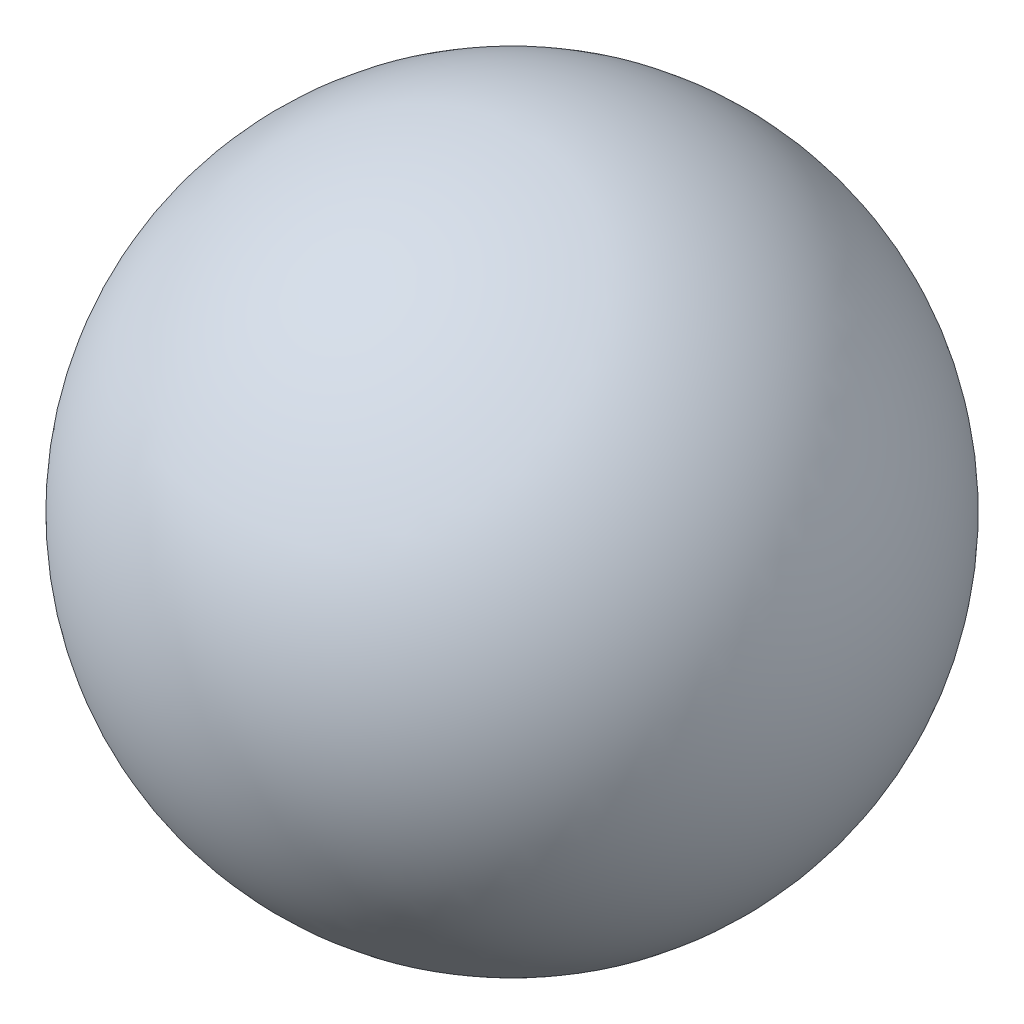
ISO-10303-21;
HEADER;
FILE_DESCRIPTION(('STEP AP214'),'2;1');
FILE_NAME('part.step','',(''),(''),'','','');
FILE_SCHEMA(('AUTOMOTIVE_DESIGN { 1 0 10303 214 1 1 1 1 }'));
ENDSEC;
DATA;
#1=APPLICATION_CONTEXT('core data for automotive mechanical design processes');
#2=APPLICATION_PROTOCOL_DEFINITION('international standard','automotive_design',2000,#1);
#3=PRODUCT_CONTEXT('',#1,'mechanical');
#4=PRODUCT('Part','Part','',(#3));
#5=PRODUCT_RELATED_PRODUCT_CATEGORY('part','',(#4));
#6=PRODUCT_DEFINITION_FORMATION('','',#4);
#7=PRODUCT_DEFINITION_CONTEXT('part definition',#1,'design');
#8=PRODUCT_DEFINITION('design','',#6,#7);
#9=PRODUCT_DEFINITION_SHAPE('','',#8);
#10=(LENGTH_UNIT() NAMED_UNIT(*) SI_UNIT(.MILLI.,.METRE.));
#11=(NAMED_UNIT(*) PLANE_ANGLE_UNIT() SI_UNIT($,.RADIAN.));
#12=(NAMED_UNIT(*) SI_UNIT($,.STERADIAN.) SOLID_ANGLE_UNIT());
#13=UNCERTAINTY_MEASURE_WITH_UNIT(LENGTH_MEASURE(1.E-05),#10,'distance_accuracy_value','');
#14=(GEOMETRIC_REPRESENTATION_CONTEXT(3) GLOBAL_UNCERTAINTY_ASSIGNED_CONTEXT((#13)) GLOBAL_UNIT_ASSIGNED_CONTEXT((#10,
#11,#12)) REPRESENTATION_CONTEXT('',''));
#15=CARTESIAN_POINT('',(0.,0.,0.));
#16=DIRECTION('',(0.,0.,1.));
#17=DIRECTION('',(1.,0.,0.));
#18=AXIS2_PLACEMENT_3D('',#15,#16,#17);
#19=CARTESIAN_POINT('',(0.,0.,0.));
#20=DIRECTION('',(0.,1.,0.));
#21=DIRECTION('',(1.,0.,0.));
#22=AXIS2_PLACEMENT_3D('',#19,#20,#21);
#23=SPHERICAL_SURFACE('',#22,19.685);
#24=CARTESIAN_POINT('',(0.,19.685,0.));
#25=VERTEX_POINT('',#24);
#26=VERTEX_LOOP('',#25);
#27=FACE_BOUND('',#26,.T.);
#28=ADVANCED_FACE('F28',(#27),#23,.T.);
#29=CLOSED_SHELL('',(#28));
#30=MANIFOLD_SOLID_BREP('B2',#29);
#31=ADVANCED_BREP_SHAPE_REPRESENTATION('',(#18,#30),#14);
#32=SHAPE_DEFINITION_REPRESENTATION(#9,#31);
ENDSEC;
END-ISO-10303-21;
